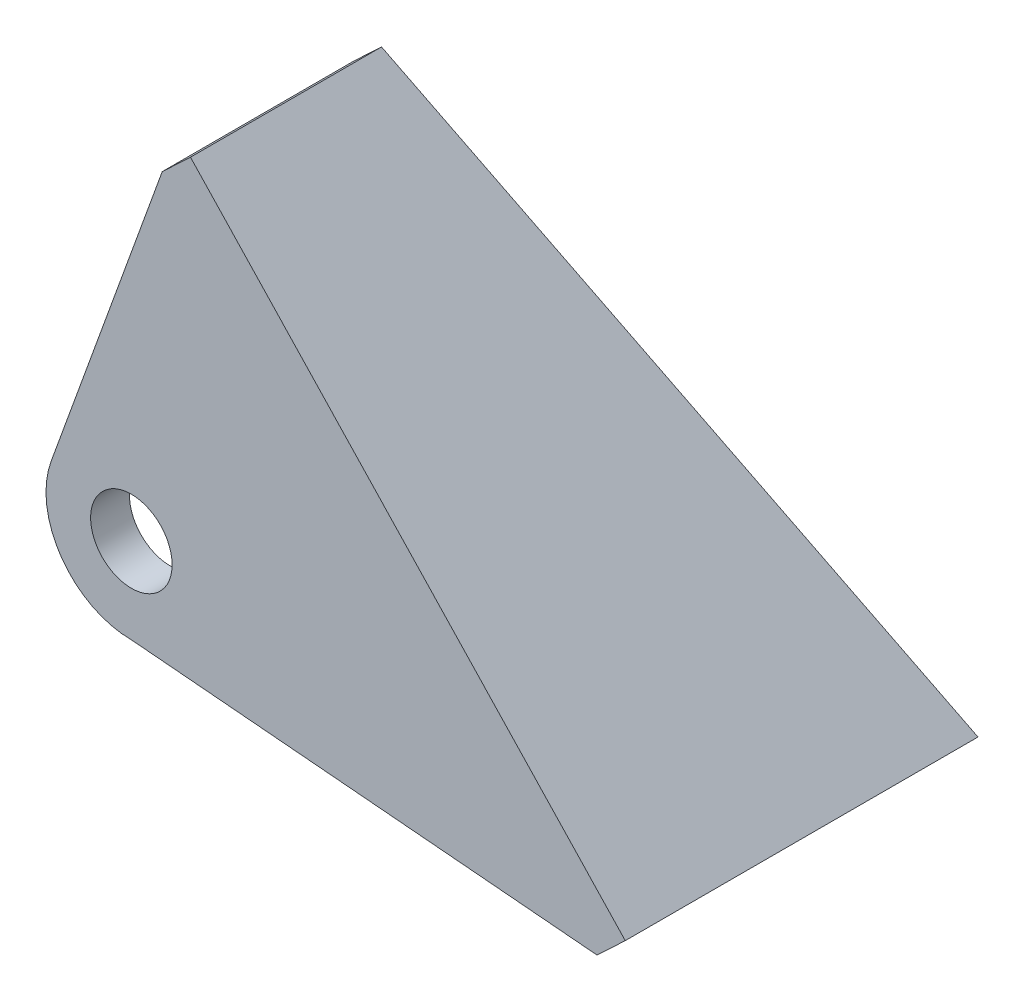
from build123d import *

# Parameters (mm, degrees)
ESQUISSE1_R        = 5.25
EXTRUSION1_DEPTH   = 5
BOSS_EXTRU_1_DEPTH = 5


with BuildPart() as part:
    # Esquisse1 → Extrusion1 (new body)
    with BuildSketch(Plane.XY.offset(-20)):
        with BuildLine():
            Line((-25.340942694, -6.249679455), (-11.021536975, 33.233919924))
            Line((-11.021536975, 33.233919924), (45, -26.179731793))
            Line((45, -26.179731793), (-15, -21))
            ThreePointArc((-15, -21), (-24.007039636, -16.314525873), (-25.340942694, -6.249679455))
        make_face()
        with Locations((-15, -10)):
            Circle(ESQUISSE1_R, mode=Mode.SUBTRACT)
    extrude(amount=EXTRUSION1_DEPTH)

    # Esquisse2 → Boss.-Extru.1 (add)
    with BuildSketch(Plane(origin=(10.753925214, 10.139949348, 0), x_dir=(0, 0, -1), z_dir=(0.7275713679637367, 0.6860319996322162, 0))):
        Polygon((15, 31.741175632), (39.611687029, 31.741175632), (60.447955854, -49.919063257), (15, -49.919063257), align=None)
    extrude(amount=BOSS_EXTRU_1_DEPTH)


solid = part.part
